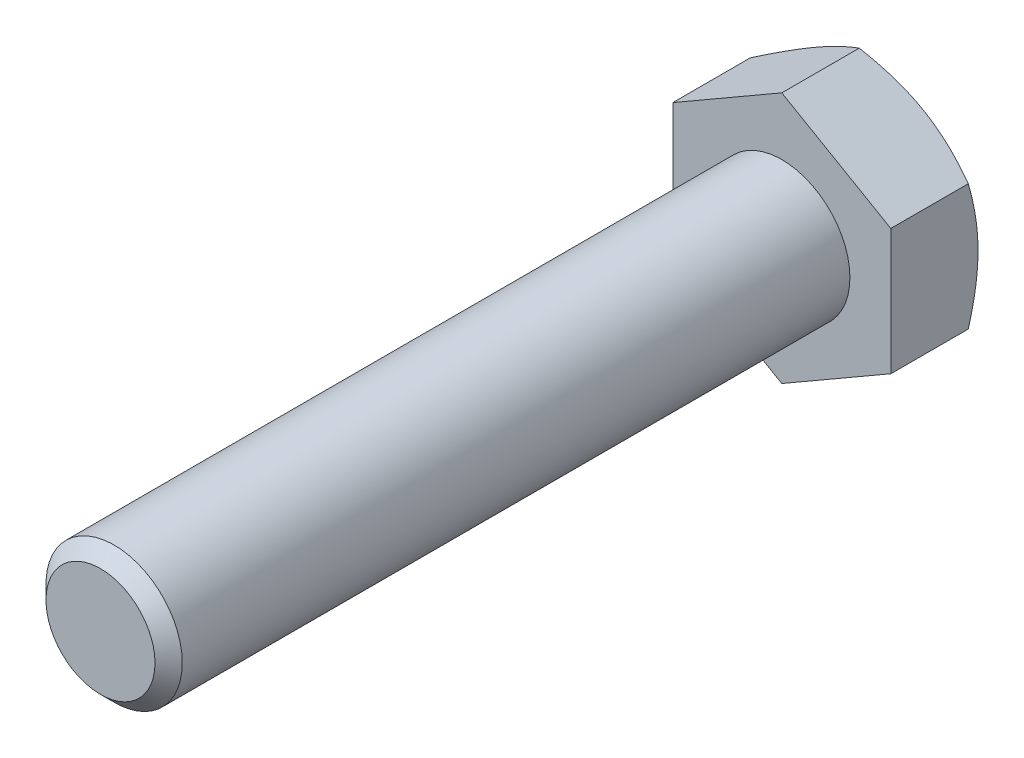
ISO-10303-21;
HEADER;
FILE_DESCRIPTION(('STEP AP214'),'2;1');
FILE_NAME('part.step','',(''),(''),'','','');
FILE_SCHEMA(('AUTOMOTIVE_DESIGN { 1 0 10303 214 1 1 1 1 }'));
ENDSEC;
DATA;
#1=APPLICATION_CONTEXT('core data for automotive mechanical design processes');
#2=APPLICATION_PROTOCOL_DEFINITION('international standard','automotive_design',2000,#1);
#3=PRODUCT_CONTEXT('',#1,'mechanical');
#4=PRODUCT('Part','Part','',(#3));
#5=PRODUCT_RELATED_PRODUCT_CATEGORY('part','',(#4));
#6=PRODUCT_DEFINITION_FORMATION('','',#4);
#7=PRODUCT_DEFINITION_CONTEXT('part definition',#1,'design');
#8=PRODUCT_DEFINITION('design','',#6,#7);
#9=PRODUCT_DEFINITION_SHAPE('','',#8);
#10=(LENGTH_UNIT() NAMED_UNIT(*) SI_UNIT(.MILLI.,.METRE.));
#11=(NAMED_UNIT(*) PLANE_ANGLE_UNIT() SI_UNIT($,.RADIAN.));
#12=(NAMED_UNIT(*) SI_UNIT($,.STERADIAN.) SOLID_ANGLE_UNIT());
#13=UNCERTAINTY_MEASURE_WITH_UNIT(LENGTH_MEASURE(1.E-05),#10,'distance_accuracy_value','');
#14=(GEOMETRIC_REPRESENTATION_CONTEXT(3) GLOBAL_UNCERTAINTY_ASSIGNED_CONTEXT((#13)) GLOBAL_UNIT_ASSIGNED_CONTEXT((#10,
#11,#12)) REPRESENTATION_CONTEXT('',''));
#15=CARTESIAN_POINT('',(0.,0.,0.));
#16=DIRECTION('',(0.,0.,1.));
#17=DIRECTION('',(1.,0.,0.));
#18=AXIS2_PLACEMENT_3D('',#15,#16,#17);
#19=CARTESIAN_POINT('',(1.38777878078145E-13,-3.60822483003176E-13,49.9999999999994));
#20=DIRECTION('',(0.,0.,0.999999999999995));
#21=DIRECTION('',(1.00000000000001,0.,0.));
#22=AXIS2_PLACEMENT_3D('',#19,#20,#21);
#23=PLANE('',#22);
#24=CARTESIAN_POINT('',(1.38777878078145E-13,-3.60822483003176E-13,49.9999999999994));
#25=DIRECTION('',(0.,0.,0.999999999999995));
#26=DIRECTION('',(1.00000000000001,0.,0.));
#27=AXIS2_PLACEMENT_3D('',#24,#25,#26);
#28=CIRCLE('',#27,4.);
#29=CARTESIAN_POINT('',(4.00000000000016,-3.60822483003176E-13,49.9999999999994));
#30=VERTEX_POINT('',#29);
#31=EDGE_CURVE('E265',#30,#30,#28,.T.);
#32=ORIENTED_EDGE('',*,*,#31,.T.);
#33=EDGE_LOOP('',(#32));
#34=FACE_BOUND('',#33,.T.);
#35=ADVANCED_FACE('F34',(#34),#23,.T.);
#36=CARTESIAN_POINT('',(0.,-4.9960036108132E-13,0.));
#37=DIRECTION('',(0.,0.,0.999999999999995));
#38=DIRECTION('',(1.00000000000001,0.,0.));
#39=AXIS2_PLACEMENT_3D('',#36,#37,#38);
#40=CYLINDRICAL_SURFACE('',#39,5.);
#41=CARTESIAN_POINT('',(0.,0.,48.9999999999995));
#42=DIRECTION('',(0.,0.,0.999999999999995));
#43=DIRECTION('',(1.00000000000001,0.,0.));
#44=AXIS2_PLACEMENT_3D('',#41,#42,#43);
#45=CIRCLE('',#44,5.);
#46=CARTESIAN_POINT('',(5.00000000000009,-4.99600361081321E-13,48.9999999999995));
#47=VERTEX_POINT('',#46);
#48=EDGE_CURVE('E236',#47,#47,#45,.F.);
#49=CARTESIAN_POINT('',(0.,-4.9960036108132E-13,0.));
#50=DIRECTION('',(0.,0.,0.999999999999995));
#51=DIRECTION('',(1.00000000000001,0.,0.));
#52=AXIS2_PLACEMENT_3D('',#49,#50,#51);
#53=CIRCLE('',#52,5.);
#54=CARTESIAN_POINT('',(5.00000000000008,-4.9960036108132E-13,0.));
#55=VERTEX_POINT('',#54);
#56=EDGE_CURVE('E262',#55,#55,#53,.F.);
#57=CARTESIAN_POINT('',(5.00000000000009,-4.99600361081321E-13,48.9999999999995));
#58=CARTESIAN_POINT('',(5.00000000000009,-4.99600361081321E-13,48.4895833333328));
#59=CARTESIAN_POINT('',(5.00000000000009,-4.99600361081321E-13,47.9791666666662));
#60=CARTESIAN_POINT('',(5.00000000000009,-4.99600361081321E-13,46.9583333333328));
#61=CARTESIAN_POINT('',(5.00000000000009,-4.99600361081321E-13,46.4479166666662));
#62=CARTESIAN_POINT('',(5.00000000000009,-4.99600361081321E-13,45.4270833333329));
#63=CARTESIAN_POINT('',(5.00000000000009,-4.99600361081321E-13,44.9166666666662));
#64=CARTESIAN_POINT('',(5.00000000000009,-4.99600361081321E-13,43.8958333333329));
#65=CARTESIAN_POINT('',(5.00000000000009,-4.9960036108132E-13,43.3854166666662));
#66=CARTESIAN_POINT('',(5.00000000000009,-4.9960036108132E-13,42.3645833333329));
#67=CARTESIAN_POINT('',(5.00000000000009,-4.9960036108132E-13,41.8541666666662));
#68=CARTESIAN_POINT('',(5.00000000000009,-4.9960036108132E-13,40.8333333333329));
#69=CARTESIAN_POINT('',(5.00000000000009,-4.9960036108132E-13,40.3229166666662));
#70=CARTESIAN_POINT('',(5.00000000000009,-4.9960036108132E-13,39.3020833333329));
#71=CARTESIAN_POINT('',(5.00000000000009,-4.9960036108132E-13,38.7916666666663));
#72=CARTESIAN_POINT('',(5.00000000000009,-4.9960036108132E-13,37.7708333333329));
#73=CARTESIAN_POINT('',(5.00000000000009,-4.9960036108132E-13,37.2604166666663));
#74=CARTESIAN_POINT('',(5.00000000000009,-4.9960036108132E-13,36.239583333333));
#75=CARTESIAN_POINT('',(5.00000000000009,-4.9960036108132E-13,35.7291666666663));
#76=CARTESIAN_POINT('',(5.00000000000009,-4.9960036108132E-13,34.708333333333));
#77=CARTESIAN_POINT('',(5.00000000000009,-4.9960036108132E-13,34.1979166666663));
#78=CARTESIAN_POINT('',(5.00000000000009,-4.9960036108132E-13,33.177083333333));
#79=CARTESIAN_POINT('',(5.00000000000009,-4.9960036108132E-13,32.6666666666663));
#80=CARTESIAN_POINT('',(5.00000000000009,-4.9960036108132E-13,31.645833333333));
#81=CARTESIAN_POINT('',(5.00000000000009,-4.9960036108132E-13,31.1354166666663));
#82=CARTESIAN_POINT('',(5.00000000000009,-4.9960036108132E-13,30.114583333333));
#83=CARTESIAN_POINT('',(5.00000000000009,-4.9960036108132E-13,29.6041666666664));
#84=CARTESIAN_POINT('',(5.00000000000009,-4.9960036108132E-13,28.583333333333));
#85=CARTESIAN_POINT('',(5.00000000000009,-4.9960036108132E-13,28.0729166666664));
#86=CARTESIAN_POINT('',(5.00000000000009,-4.9960036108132E-13,27.0520833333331));
#87=CARTESIAN_POINT('',(5.00000000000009,-4.9960036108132E-13,26.5416666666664));
#88=CARTESIAN_POINT('',(5.00000000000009,-4.9960036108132E-13,25.5208333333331));
#89=CARTESIAN_POINT('',(5.00000000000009,-4.9960036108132E-13,25.0104166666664));
#90=CARTESIAN_POINT('',(5.00000000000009,-4.9960036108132E-13,23.9895833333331));
#91=CARTESIAN_POINT('',(5.00000000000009,-4.9960036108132E-13,23.4791666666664));
#92=CARTESIAN_POINT('',(5.00000000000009,-4.9960036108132E-13,22.4583333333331));
#93=CARTESIAN_POINT('',(5.00000000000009,-4.9960036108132E-13,21.9479166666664));
#94=CARTESIAN_POINT('',(5.00000000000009,-4.9960036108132E-13,20.9270833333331));
#95=CARTESIAN_POINT('',(5.00000000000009,-4.9960036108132E-13,20.4166666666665));
#96=CARTESIAN_POINT('',(5.00000000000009,-4.9960036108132E-13,19.3958333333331));
#97=CARTESIAN_POINT('',(5.00000000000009,-4.9960036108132E-13,18.8854166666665));
#98=CARTESIAN_POINT('',(5.00000000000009,-4.9960036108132E-13,17.8645833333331));
#99=CARTESIAN_POINT('',(5.00000000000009,-4.9960036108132E-13,17.3541666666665));
#100=CARTESIAN_POINT('',(5.00000000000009,-4.9960036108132E-13,16.3333333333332));
#101=CARTESIAN_POINT('',(5.00000000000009,-4.9960036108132E-13,15.8229166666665));
#102=CARTESIAN_POINT('',(5.00000000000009,-4.9960036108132E-13,14.8020833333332));
#103=CARTESIAN_POINT('',(5.00000000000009,-4.9960036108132E-13,14.2916666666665));
#104=CARTESIAN_POINT('',(5.00000000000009,-4.9960036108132E-13,13.2708333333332));
#105=CARTESIAN_POINT('',(5.00000000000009,-4.9960036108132E-13,12.7604166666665));
#106=CARTESIAN_POINT('',(5.00000000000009,-4.9960036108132E-13,11.7395833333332));
#107=CARTESIAN_POINT('',(5.00000000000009,-4.9960036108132E-13,11.2291666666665));
#108=CARTESIAN_POINT('',(5.00000000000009,-4.9960036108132E-13,10.2083333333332));
#109=CARTESIAN_POINT('',(5.00000000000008,-4.9960036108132E-13,9.69791666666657));
#110=CARTESIAN_POINT('',(5.00000000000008,-4.9960036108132E-13,8.67708333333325));
#111=CARTESIAN_POINT('',(5.00000000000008,-4.9960036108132E-13,8.16666666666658));
#112=CARTESIAN_POINT('',(5.00000000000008,-4.9960036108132E-13,7.14583333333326));
#113=CARTESIAN_POINT('',(5.00000000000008,-4.9960036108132E-13,6.6354166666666));
#114=CARTESIAN_POINT('',(5.00000000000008,-4.9960036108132E-13,5.61458333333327));
#115=CARTESIAN_POINT('',(5.00000000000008,-4.9960036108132E-13,5.10416666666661));
#116=CARTESIAN_POINT('',(5.00000000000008,-4.9960036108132E-13,4.08333333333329));
#117=CARTESIAN_POINT('',(5.00000000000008,-4.9960036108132E-13,3.57291666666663));
#118=CARTESIAN_POINT('',(5.00000000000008,-4.9960036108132E-13,2.5520833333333));
#119=CARTESIAN_POINT('',(5.00000000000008,-4.9960036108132E-13,2.04166666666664));
#120=CARTESIAN_POINT('',(5.00000000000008,-4.9960036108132E-13,1.02083333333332));
#121=CARTESIAN_POINT('',(5.00000000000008,-4.9960036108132E-13,0.51041666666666));
#122=CARTESIAN_POINT('',(5.00000000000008,-4.9960036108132E-13,0.));
#123=B_SPLINE_CURVE_WITH_KNOTS('',3,(#57,#58,#59,#60,#61,#62,#63,#64,#65,#66,#67,#68,#69,#70,
#71,#72,#73,#74,#75,#76,#77,#78,#79,#80,#81,#82,#83,#84,#85,#86,#87,#88,#89,#90,#91,#92,#93,#94,
#95,#96,#97,#98,#99,#100,#101,#102,#103,#104,#105,#106,#107,#108,#109,#110,#111,#112,#113,#114,
#115,#116,#117,#118,#119,#120,#121,#122),.UNSPECIFIED.,.F.,.F.,(4,2,2,2,2,2,2,2,2,2,2,2,2,2,2,2,
2,2,2,2,2,2,2,2,2,2,2,2,2,2,2,2,4),(0.,1.53124999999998,3.06249999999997,4.59374999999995,
6.12499999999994,7.65624999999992,9.1874999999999,10.7187499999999,12.2499999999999,
13.7812499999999,15.3124999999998,16.8437499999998,18.3749999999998,19.9062499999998,
21.4374999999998,22.9687499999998,24.4999999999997,26.0312499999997,27.5624999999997,
29.0937499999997,30.6249999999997,32.1562499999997,33.6874999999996,35.2187499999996,
36.7499999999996,38.2812499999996,39.8124999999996,41.3437499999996,42.8749999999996,
44.4062499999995,45.9374999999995,47.4687499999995,48.9999999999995),.UNSPECIFIED.);
#124=EDGE_CURVE('BSEAM200',#47,#55,#123,.T.);
#125=ORIENTED_EDGE('',*,*,#48,.T.);
#126=ORIENTED_EDGE('',*,*,#56,.F.);
#127=ORIENTED_EDGE('',*,*,#124,.T.);
#128=ORIENTED_EDGE('',*,*,#124,.F.);
#129=EDGE_LOOP('',(#125,#127,#126,#128));
#130=FACE_BOUND('',#129,.T.);
#131=ADVANCED_FACE('F200',(#130),#40,.T.);
#132=CARTESIAN_POINT('',(1.38777878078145E-13,-3.60822483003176E-13,49.9999999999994));
#133=DIRECTION('',(0.,0.,-0.999999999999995));
#134=DIRECTION('',(-1.00000000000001,0.,0.));
#135=AXIS2_PLACEMENT_3D('',#132,#133,#134);
#136=CONICAL_SURFACE('',#135,4.,0.785398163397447);
#137=ORIENTED_EDGE('',*,*,#48,.F.);
#138=EDGE_LOOP('',(#137));
#139=FACE_BOUND('',#138,.T.);
#140=ORIENTED_EDGE('',*,*,#31,.F.);
#141=EDGE_LOOP('',(#140));
#142=FACE_BOUND('',#141,.T.);
#143=ADVANCED_FACE('F36',(#139,#142),#136,.T.);
#144=CARTESIAN_POINT('',(0.,9.23760430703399,-6.39999999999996));
#145=DIRECTION('',(0.500000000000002,0.866025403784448,0.));
#146=DIRECTION('',(-0.866025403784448,0.500000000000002,0.));
#147=AXIS2_PLACEMENT_3D('',#144,#145,#146);
#148=PLANE('',#147);
#149=CARTESIAN_POINT('',(-0.000200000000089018,9.23771977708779,-5.68540215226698));
#150=CARTESIAN_POINT('',(0.175648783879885,9.13619343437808,-5.74400928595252));
#151=CARTESIAN_POINT('',(0.352153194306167,9.03428856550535,-5.79995659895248));
#152=CARTESIAN_POINT('',(0.706595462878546,8.82965122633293,-5.90579899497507));
#153=CARTESIAN_POINT('',(0.884533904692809,8.72691841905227,-5.95569146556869));
#154=CARTESIAN_POINT('',(1.4211982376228,8.41707512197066,-6.09530720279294));
#155=CARTESIAN_POINT('',(1.78204258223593,8.20874154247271,-6.17471882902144));
#156=CARTESIAN_POINT('',(2.32203917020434,7.89697436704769,-6.26783835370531));
#157=CARTESIAN_POINT('',(2.4995781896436,7.79447216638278,-6.29436541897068));
#158=CARTESIAN_POINT('',(2.85545911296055,7.58900421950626,-6.33884682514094));
#159=CARTESIAN_POINT('',(3.0338009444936,7.48603851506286,-6.35680192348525));
#160=CARTESIAN_POINT('',(3.39079168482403,7.27992981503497,-6.38368435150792));
#161=CARTESIAN_POINT('',(3.56944001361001,7.17678715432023,-6.39262192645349));
#162=CARTESIAN_POINT('',(3.92690170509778,6.97040655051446,-6.40127769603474));
#163=CARTESIAN_POINT('',(4.10571506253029,6.86716861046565,-6.40099617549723));
#164=CARTESIAN_POINT('',(4.44001336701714,6.6741613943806,-6.39185497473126));
#165=CARTESIAN_POINT('',(4.59552190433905,6.5843784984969,-6.38411039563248));
#166=CARTESIAN_POINT('',(4.90617476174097,6.40502298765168,-6.36179886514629));
#167=CARTESIAN_POINT('',(5.0613190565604,6.31545038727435,-6.34723145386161));
#168=CARTESIAN_POINT('',(5.52615131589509,6.04707935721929,-6.2936393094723));
#169=CARTESIAN_POINT('',(5.83501648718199,5.86875596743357,-6.24473135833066));
#170=CARTESIAN_POINT('',(6.45602322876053,5.5102175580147,-6.12246059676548));
#171=CARTESIAN_POINT('',(6.76808554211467,5.33004829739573,-6.04857947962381));
#172=CARTESIAN_POINT('',(7.38755648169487,4.97239658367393,-5.88089985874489));
#173=CARTESIAN_POINT('',(7.69497304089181,4.7949095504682,-5.78714073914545));
#174=CARTESIAN_POINT('',(8.00020000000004,4.61868668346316,-5.68540215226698));
#175=B_SPLINE_CURVE_WITH_KNOTS('',3,(#149,#150,#151,#152,#153,#154,#155,#156,#157,#158,#159,
#160,#161,#162,#163,#164,#165,#166,#167,#168,#169,#170,#171,#172,#173,#174),.UNSPECIFIED.,.F.,
.F.,(4,2,2,2,2,2,2,2,2,2,2,2,4),(0.,0.633973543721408,1.26821965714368,2.53934712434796,
3.15934343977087,3.77928496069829,4.39852133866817,5.01773858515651,5.55680239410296,
6.09590254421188,7.17487077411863,8.27776850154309,9.37850115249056),.UNSPECIFIED.);
#176=CARTESIAN_POINT('',(0.,9.23760430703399,-5.68546882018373));
#177=VERTEX_POINT('',#176);
#178=CARTESIAN_POINT('',(3.99999999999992,6.92820323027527,-6.39999999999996));
#179=VERTEX_POINT('',#178);
#180=EDGE_CURVE('E224',#177,#179,#175,.T.);
#181=ORIENTED_EDGE('',*,*,#180,.F.);
#182=DIRECTION('',(0.,0.,0.999999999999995));
#183=VECTOR('',#182,1.);
#184=CARTESIAN_POINT('',(0.,9.23760430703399,-6.39999999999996));
#185=LINE('',#184,#183);
#186=CARTESIAN_POINT('',(0.,9.23760430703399,0.));
#187=VERTEX_POINT('',#186);
#188=EDGE_CURVE('E221',#177,#187,#185,.T.);
#189=ORIENTED_EDGE('',*,*,#188,.T.);
#190=DIRECTION('',(-0.866025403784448,0.500000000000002,0.));
#191=VECTOR('',#190,1.);
#192=CARTESIAN_POINT('',(0.,9.23760430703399,0.));
#193=LINE('',#192,#191);
#194=CARTESIAN_POINT('',(8.00000000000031,4.61880215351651,0.));
#195=VERTEX_POINT('',#194);
#196=EDGE_CURVE('E229',#195,#187,#193,.T.);
#197=ORIENTED_EDGE('',*,*,#196,.F.);
#198=DIRECTION('',(0.,0.,0.999999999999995));
#199=VECTOR('',#198,1.);
#200=CARTESIAN_POINT('',(8.00000000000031,4.61880215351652,-6.39999999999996));
#201=LINE('',#200,#199);
#202=CARTESIAN_POINT('',(8.00000000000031,4.61880215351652,-5.68546882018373));
#203=VERTEX_POINT('',#202);
#204=EDGE_CURVE('E254',#203,#195,#201,.T.);
#205=ORIENTED_EDGE('',*,*,#204,.F.);
#206=EDGE_CURVE('E174',#179,#203,#175,.T.);
#207=ORIENTED_EDGE('',*,*,#206,.F.);
#208=EDGE_LOOP('',(#181,#189,#197,#205,#207));
#209=FACE_BOUND('',#208,.T.);
#210=ADVANCED_FACE('F184',(#209),#148,.T.);
#211=CARTESIAN_POINT('',(8.00000000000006,-4.61880215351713,-6.39999999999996));
#212=DIRECTION('',(1.00000000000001,0.,0.));
#213=DIRECTION('',(0.,1.00000000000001,0.));
#214=AXIS2_PLACEMENT_3D('',#211,#212,#213);
#215=PLANE('',#214);
#216=CARTESIAN_POINT('',(8.00000000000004,-12.5978512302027,-2.4028120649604));
#217=CARTESIAN_POINT('',(8.00000000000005,-12.246746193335,-2.57388946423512));
#218=CARTESIAN_POINT('',(8.00000000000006,-11.8948553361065,-2.74338074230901));
#219=CARTESIAN_POINT('',(8.00000000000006,-11.1890846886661,-3.07830251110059));
#220=CARTESIAN_POINT('',(8.00000000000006,-10.835204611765,-3.24373239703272));
#221=CARTESIAN_POINT('',(8.00000000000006,-10.123305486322,-3.57043443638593));
#222=CARTESIAN_POINT('',(8.00000000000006,-9.76527449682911,-3.73168065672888));
#223=CARTESIAN_POINT('',(8.00000000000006,-9.04643054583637,-4.04782365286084));
#224=CARTESIAN_POINT('',(8.00000000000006,-8.68561771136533,-4.20272071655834));
#225=CARTESIAN_POINT('',(8.00000000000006,-7.9483682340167,-4.50960168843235));
#226=CARTESIAN_POINT('',(8.00000000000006,-7.57181608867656,-4.66130959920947));
#227=CARTESIAN_POINT('',(8.00000000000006,-6.81437869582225,-4.95369969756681));
#228=CARTESIAN_POINT('',(8.00000000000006,-6.43349297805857,-5.09438067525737));
#229=CARTESIAN_POINT('',(8.00000000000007,-5.66743059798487,-5.36116349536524));
#230=CARTESIAN_POINT('',(8.00000000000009,-5.28226375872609,-5.48729325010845));
#231=CARTESIAN_POINT('',(8.00000000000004,-4.50642197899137,-5.72105487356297));
#232=CARTESIAN_POINT('',(7.99999999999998,-4.11574875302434,-5.82869236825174));
#233=CARTESIAN_POINT('',(7.99999999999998,-3.33076858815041,-6.01985550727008));
#234=CARTESIAN_POINT('',(8.00000000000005,-2.93649538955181,-6.10351603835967));
#235=CARTESIAN_POINT('',(8.00000000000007,-2.34134760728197,-6.20749259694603));
#236=CARTESIAN_POINT('',(8.00000000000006,-2.14232908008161,-6.23856705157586));
#237=CARTESIAN_POINT('',(8.00000000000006,-1.7432391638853,-6.29294025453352));
#238=CARTESIAN_POINT('',(8.00000000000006,-1.54316787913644,-6.31623975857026));
#239=CARTESIAN_POINT('',(8.00000000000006,-1.14493807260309,-6.35429623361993));
#240=CARTESIAN_POINT('',(8.00000000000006,-0.946790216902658,-6.36916434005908));
#241=CARTESIAN_POINT('',(8.00000000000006,-0.550042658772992,-6.39050002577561));
#242=CARTESIAN_POINT('',(8.00000000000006,-0.351442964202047,-6.39696775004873));
#243=CARTESIAN_POINT('',(8.00000000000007,0.0458536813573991,-6.40134753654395));
#244=CARTESIAN_POINT('',(8.00000000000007,0.244550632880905,-6.39925955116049));
#245=CARTESIAN_POINT('',(8.00000000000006,0.641675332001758,-6.38658102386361));
#246=CARTESIAN_POINT('',(8.00000000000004,0.840103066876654,-6.37599009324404));
#247=CARTESIAN_POINT('',(8.00000000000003,1.31123186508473,-6.34097810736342));
#248=CARTESIAN_POINT('',(8.00000000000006,1.58366327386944,-6.31284309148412));
#249=CARTESIAN_POINT('',(8.00000000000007,2.12661564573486,-6.24203710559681));
#250=CARTESIAN_POINT('',(8.00000000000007,2.39713636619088,-6.19936432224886));
#251=CARTESIAN_POINT('',(8.00000000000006,3.20545284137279,-6.0517930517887));
#252=CARTESIAN_POINT('',(8.00000000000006,3.73973646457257,-5.92736416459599));
#253=CARTESIAN_POINT('',(8.00000000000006,4.53906436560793,-5.71012995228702));
#254=CARTESIAN_POINT('',(8.00000000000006,4.8082118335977,-5.63154182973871));
#255=CARTESIAN_POINT('',(8.00000000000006,5.34389592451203,-5.46584170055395));
#256=CARTESIAN_POINT('',(8.00000000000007,5.61043252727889,-5.37872962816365));
#257=CARTESIAN_POINT('',(8.00000000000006,6.14097486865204,-5.19740915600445));
#258=CARTESIAN_POINT('',(8.00000000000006,6.40498129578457,-5.10320275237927));
#259=CARTESIAN_POINT('',(8.00000000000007,6.93077992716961,-4.90883812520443));
#260=CARTESIAN_POINT('',(8.00000000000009,7.19257218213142,-4.80868003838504));
#261=CARTESIAN_POINT('',(8.0000000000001,7.89757234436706,-4.53123135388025));
#262=CARTESIAN_POINT('',(8.00000000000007,8.33892089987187,-4.34922056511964));
#263=CARTESIAN_POINT('',(8.00000000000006,9.21706508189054,-3.97449001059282));
#264=CARTESIAN_POINT('',(8.00000000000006,9.65386019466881,-3.78176905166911));
#265=CARTESIAN_POINT('',(8.00000000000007,10.5239434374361,-3.3881548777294));
#266=CARTESIAN_POINT('',(8.00000000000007,10.9572301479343,-3.18725853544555));
#267=CARTESIAN_POINT('',(8.00000000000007,11.8208356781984,-2.77925077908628));
#268=CARTESIAN_POINT('',(8.00000000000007,12.2511546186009,-2.5721396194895));
#269=CARTESIAN_POINT('',(8.00000000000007,13.110106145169,-2.15271844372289));
#270=CARTESIAN_POINT('',(8.00000000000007,13.5387348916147,-1.94040058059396));
#271=CARTESIAN_POINT('',(8.00000000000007,14.3940561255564,-1.51189757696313));
#272=CARTESIAN_POINT('',(8.00000000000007,14.820748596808,-1.29571240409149));
#273=CARTESIAN_POINT('',(8.00000000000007,15.6724483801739,-0.860283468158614));
#274=CARTESIAN_POINT('',(8.00000000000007,16.0974560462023,-0.641040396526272));
#275=CARTESIAN_POINT('',(8.00000000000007,16.9461557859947,-0.200021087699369));
#276=CARTESIAN_POINT('',(8.00000000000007,17.3698478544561,0.0217551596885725));
#277=CARTESIAN_POINT('',(8.00000000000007,18.5495919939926,0.642968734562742));
#278=CARTESIAN_POINT('',(8.00000000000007,19.3044430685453,1.04468640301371));
#279=CARTESIAN_POINT('',(8.00000000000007,20.811612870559,1.85294502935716));
#280=CARTESIAN_POINT('',(8.00000000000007,21.5639314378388,2.25948628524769));
#281=CARTESIAN_POINT('',(8.00000000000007,23.0640825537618,3.07479055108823));
#282=CARTESIAN_POINT('',(8.00000000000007,23.8119216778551,3.48354147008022));
#283=CARTESIAN_POINT('',(8.00000000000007,24.9325210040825,4.09870759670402));
#284=CARTESIAN_POINT('',(8.00000000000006,25.3058462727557,4.30409483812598));
#285=CARTESIAN_POINT('',(8.00000000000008,26.0521604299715,4.71547851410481));
#286=CARTESIAN_POINT('',(8.0000000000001,26.4251493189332,4.92147494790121));
#287=CARTESIAN_POINT('',(8.00000000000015,26.7979906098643,5.12773824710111));
#288=B_SPLINE_CURVE_WITH_KNOTS('',3,(#216,#217,#218,#219,#220,#221,#222,#223,#224,#225,#226,
#227,#228,#229,#230,#231,#232,#233,#234,#235,#236,#237,#238,#239,#240,#241,#242,#243,#244,#245,
#246,#247,#248,#249,#250,#251,#252,#253,#254,#255,#256,#257,#258,#259,#260,#261,#262,#263,#264,
#265,#266,#267,#268,#269,#270,#271,#272,#273,#274,#275,#276,#277,#278,#279,#280,#281,#282,#283,
#284,#285,#286,#287),.UNSPECIFIED.,.F.,.F.,(4,2,2,2,2,2,2,2,2,2,2,2,2,2,2,2,2,2,2,2,2,2,2,2,2,2,
2,2,2,2,2,2,2,2,2,4),(0.,1.17171303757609,2.34359951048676,3.52154779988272,4.69944261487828,
5.9172006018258,7.13509201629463,8.35060698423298,9.56575149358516,10.7739194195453,
11.3780811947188,11.982184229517,12.5781274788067,13.1740604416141,13.7699967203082,
14.3659602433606,15.1871414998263,16.0084252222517,17.651791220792,18.4928743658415,
19.3339639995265,20.1748178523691,21.0156523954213,22.4476587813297,23.8798250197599,
25.3125443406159,26.7452050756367,28.1801767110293,29.6151603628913,31.049824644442,
32.4844947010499,35.0497345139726,37.6151336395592,40.1718943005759,41.4501744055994,
42.7284529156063),.UNSPECIFIED.);
#289=CARTESIAN_POINT('',(8.00000000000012,0.,-6.39999999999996));
#290=VERTEX_POINT('',#289);
#291=EDGE_CURVE('E172',#203,#290,#288,.F.);
#292=ORIENTED_EDGE('',*,*,#291,.F.);
#293=ORIENTED_EDGE('',*,*,#204,.T.);
#294=DIRECTION('',(0.,1.00000000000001,0.));
#295=VECTOR('',#294,1.);
#296=CARTESIAN_POINT('',(8.00000000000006,-4.61880215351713,0.));
#297=LINE('',#296,#295);
#298=CARTESIAN_POINT('',(8.00000000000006,-4.61880215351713,0.));
#299=VERTEX_POINT('',#298);
#300=EDGE_CURVE('E261',#299,#195,#297,.T.);
#301=ORIENTED_EDGE('',*,*,#300,.F.);
#302=DIRECTION('',(0.,0.,0.999999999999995));
#303=VECTOR('',#302,1.);
#304=CARTESIAN_POINT('',(8.00000000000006,-4.61880215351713,-6.39999999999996));
#305=LINE('',#304,#303);
#306=CARTESIAN_POINT('',(8.00000000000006,-4.61880215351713,-5.68546882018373));
#307=VERTEX_POINT('',#306);
#308=EDGE_CURVE('E239',#307,#299,#305,.T.);
#309=ORIENTED_EDGE('',*,*,#308,.F.);
#310=EDGE_CURVE('E167',#290,#307,#288,.F.);
#311=ORIENTED_EDGE('',*,*,#310,.F.);
#312=EDGE_LOOP('',(#292,#293,#301,#309,#311));
#313=FACE_BOUND('',#312,.T.);
#314=ADVANCED_FACE('F180',(#313),#215,.T.);
#315=CARTESIAN_POINT('',(0.,-9.23760430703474,-6.39999999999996));
#316=DIRECTION('',(0.500000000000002,-0.866025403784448,0.));
#317=DIRECTION('',(0.866025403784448,0.500000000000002,0.));
#318=AXIS2_PLACEMENT_3D('',#315,#316,#317);
#319=PLANE('',#318);
#320=CARTESIAN_POINT('',(8.00020000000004,-4.61868668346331,-5.68540215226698));
#321=CARTESIAN_POINT('',(7.82435121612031,-4.72021302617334,-5.7440092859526));
#322=CARTESIAN_POINT('',(7.64784680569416,-4.82211789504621,-5.79995659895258));
#323=CARTESIAN_POINT('',(7.2934045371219,-5.02675523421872,-5.90579899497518));
#324=CARTESIAN_POINT('',(7.11546609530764,-5.12948804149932,-5.95569146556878));
#325=CARTESIAN_POINT('',(6.5788017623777,-5.43933133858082,-6.095307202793));
#326=CARTESIAN_POINT('',(6.21795741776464,-5.64766491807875,-6.17471882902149));
#327=CARTESIAN_POINT('',(5.67796082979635,-5.95943209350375,-6.26783835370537));
#328=CARTESIAN_POINT('',(5.50042181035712,-6.06193429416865,-6.29436541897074));
#329=CARTESIAN_POINT('',(5.14454088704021,-6.2674022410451,-6.338846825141));
#330=CARTESIAN_POINT('',(4.96619905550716,-6.37036794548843,-6.35680192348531));
#331=CARTESIAN_POINT('',(4.60920831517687,-6.57647664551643,-6.38368435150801));
#332=CARTESIAN_POINT('',(4.43055998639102,-6.67961930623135,-6.39262192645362));
#333=CARTESIAN_POINT('',(4.073098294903,-6.88599991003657,-6.40127769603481));
#334=CARTESIAN_POINT('',(3.89428493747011,-6.98923785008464,-6.40099617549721));
#335=CARTESIAN_POINT('',(3.5599866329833,-7.18224506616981,-6.39185497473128));
#336=CARTESIAN_POINT('',(3.40447809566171,-7.27202796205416,-6.38411039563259));
#337=CARTESIAN_POINT('',(3.09382523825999,-7.45138347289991,-6.36179886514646));
#338=CARTESIAN_POINT('',(2.93868094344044,-7.5409560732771,-6.34723145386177));
#339=CARTESIAN_POINT('',(2.47384868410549,-7.80932710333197,-6.29363930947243));
#340=CARTESIAN_POINT('',(2.16498351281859,-7.98765049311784,-6.2447313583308));
#341=CARTESIAN_POINT('',(1.54397677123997,-8.34618890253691,-6.12246059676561));
#342=CARTESIAN_POINT('',(1.23191445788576,-8.52635816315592,-6.04857947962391));
#343=CARTESIAN_POINT('',(0.612443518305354,-8.8840098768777,-5.88089985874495));
#344=CARTESIAN_POINT('',(0.305026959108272,-9.06149691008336,-5.78714073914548));
#345=CARTESIAN_POINT('',(-0.000200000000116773,-9.23771977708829,-5.68540215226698));
#346=B_SPLINE_CURVE_WITH_KNOTS('',3,(#320,#321,#322,#323,#324,#325,#326,#327,#328,#329,#330,
#331,#332,#333,#334,#335,#336,#337,#338,#339,#340,#341,#342,#343,#344,#345),.UNSPECIFIED.,.F.,
.F.,(4,2,2,2,2,2,2,2,2,2,2,2,4),(0.,0.633973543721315,1.26821965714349,2.53934712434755,
3.15934343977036,3.77928496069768,4.39852133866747,5.01773858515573,5.55680239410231,
6.09590254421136,7.17487077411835,8.27776850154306,9.3785011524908),.UNSPECIFIED.);
#347=CARTESIAN_POINT('',(3.99999999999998,-6.92820323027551,-6.39999999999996));
#348=VERTEX_POINT('',#347);
#349=EDGE_CURVE('E173',#307,#348,#346,.T.);
#350=ORIENTED_EDGE('',*,*,#349,.F.);
#351=ORIENTED_EDGE('',*,*,#308,.T.);
#352=DIRECTION('',(0.866025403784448,0.500000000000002,0.));
#353=VECTOR('',#352,1.);
#354=CARTESIAN_POINT('',(1.94289029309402E-13,-9.23760430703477,0.));
#355=LINE('',#354,#353);
#356=CARTESIAN_POINT('',(1.94289029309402E-13,-9.23760430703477,0.));
#357=VERTEX_POINT('',#356);
#358=EDGE_CURVE('E250',#357,#299,#355,.T.);
#359=ORIENTED_EDGE('',*,*,#358,.F.);
#360=DIRECTION('',(0.,0.,0.999999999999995));
#361=VECTOR('',#360,1.);
#362=CARTESIAN_POINT('',(0.,-9.23760430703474,-6.39999999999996));
#363=LINE('',#362,#361);
#364=CARTESIAN_POINT('',(1.94289029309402E-13,-9.23760430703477,-5.68546882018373));
#365=VERTEX_POINT('',#364);
#366=EDGE_CURVE('E249',#365,#357,#363,.T.);
#367=ORIENTED_EDGE('',*,*,#366,.F.);
#368=EDGE_CURVE('E161',#348,#365,#346,.T.);
#369=ORIENTED_EDGE('',*,*,#368,.F.);
#370=EDGE_LOOP('',(#350,#351,#359,#367,#369));
#371=FACE_BOUND('',#370,.T.);
#372=ADVANCED_FACE('F183',(#371),#319,.T.);
#373=CARTESIAN_POINT('',(0.,-9.23760430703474,-6.39999999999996));
#374=DIRECTION('',(-0.500000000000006,-0.866025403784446,0.));
#375=DIRECTION('',(0.866025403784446,-0.500000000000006,0.));
#376=AXIS2_PLACEMENT_3D('',#373,#374,#375);
#377=PLANE('',#376);
#378=CARTESIAN_POINT('',(0.000200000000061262,-9.23771977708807,-5.68540215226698));
#379=CARTESIAN_POINT('',(-0.175648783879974,-9.13619343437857,-5.74400928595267));
#380=CARTESIAN_POINT('',(-0.352153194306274,-9.03428856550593,-5.79995659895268));
#381=CARTESIAN_POINT('',(-0.706595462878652,-8.82965122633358,-5.9057989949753));
#382=CARTESIAN_POINT('',(-0.884533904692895,-8.72691841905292,-5.9556914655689));
#383=CARTESIAN_POINT('',(-1.42119823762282,-8.41707512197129,-6.0953072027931));
#384=CARTESIAN_POINT('',(-1.78204258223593,-8.20874154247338,-6.1747188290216));
#385=CARTESIAN_POINT('',(-2.32203917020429,-7.89697436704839,-6.26783835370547));
#386=CARTESIAN_POINT('',(-2.49957818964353,-7.79447216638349,-6.29436541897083));
#387=CARTESIAN_POINT('',(-2.85545911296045,-7.58900421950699,-6.33884682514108));
#388=CARTESIAN_POINT('',(-3.03380094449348,-7.48603851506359,-6.35680192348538));
#389=CARTESIAN_POINT('',(-3.39079168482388,-7.27992981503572,-6.38368435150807));
#390=CARTESIAN_POINT('',(-3.56944001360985,-7.176787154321,-6.39262192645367));
#391=CARTESIAN_POINT('',(-3.92690170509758,-6.97040655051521,-6.40127769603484));
#392=CARTESIAN_POINT('',(-4.10571506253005,-6.86716861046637,-6.40099617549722));
#393=CARTESIAN_POINT('',(-4.44001336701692,-6.67416139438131,-6.39185497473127));
#394=CARTESIAN_POINT('',(-4.59552190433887,-6.58437849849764,-6.38411039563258));
#395=CARTESIAN_POINT('',(-4.90617476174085,-6.40502298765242,-6.36179886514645));
#396=CARTESIAN_POINT('',(-5.06131905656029,-6.31545038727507,-6.34723145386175));
#397=CARTESIAN_POINT('',(-5.52615131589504,-6.04707935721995,-6.29363930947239));
#398=CARTESIAN_POINT('',(-5.83501648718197,-5.86875596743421,-6.24473135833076));
#399=CARTESIAN_POINT('',(-6.45602322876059,-5.51021755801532,-6.12246059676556));
#400=CARTESIAN_POINT('',(-6.76808554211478,-5.33004829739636,-6.04857947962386));
#401=CARTESIAN_POINT('',(-7.38755648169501,-4.97239658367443,-5.88089985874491));
#402=CARTESIAN_POINT('',(-7.69497304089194,-4.79490955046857,-5.78714073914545));
#403=CARTESIAN_POINT('',(-8.00020000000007,-4.61868668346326,-5.68540215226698));
#404=B_SPLINE_CURVE_WITH_KNOTS('',3,(#378,#379,#380,#381,#382,#383,#384,#385,#386,#387,#388,
#389,#390,#391,#392,#393,#394,#395,#396,#397,#398,#399,#400,#401,#402,#403),.UNSPECIFIED.,.F.,
.F.,(4,2,2,2,2,2,2,2,2,2,2,2,4),(0.,0.633973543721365,1.26821965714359,2.53934712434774,
3.1593434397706,3.77928496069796,4.3985213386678,5.0177385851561,5.55680239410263,
6.09590254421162,7.17487077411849,8.27776850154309,9.37850115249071),.UNSPECIFIED.);
#405=CARTESIAN_POINT('',(-3.99999999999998,-6.92820323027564,-6.39999999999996));
#406=VERTEX_POINT('',#405);
#407=EDGE_CURVE('E245',#365,#406,#404,.T.);
#408=ORIENTED_EDGE('',*,*,#407,.F.);
#409=ORIENTED_EDGE('',*,*,#366,.T.);
#410=DIRECTION('',(0.866025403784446,-0.500000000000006,0.));
#411=VECTOR('',#410,1.);
#412=CARTESIAN_POINT('',(1.94289029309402E-13,-9.23760430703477,0.));
#413=LINE('',#412,#411);
#414=CARTESIAN_POINT('',(-7.99999999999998,-4.61880215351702,0.));
#415=VERTEX_POINT('',#414);
#416=EDGE_CURVE('E351',#415,#357,#413,.T.);
#417=ORIENTED_EDGE('',*,*,#416,.F.);
#418=DIRECTION('',(0.,0.,0.999999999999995));
#419=VECTOR('',#418,1.);
#420=CARTESIAN_POINT('',(-7.99999999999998,-4.61880215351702,-6.39999999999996));
#421=LINE('',#420,#419);
#422=CARTESIAN_POINT('',(-7.99999999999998,-4.61880215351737,-5.68546882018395));
#423=VERTEX_POINT('',#422);
#424=EDGE_CURVE('E252',#423,#415,#421,.T.);
#425=ORIENTED_EDGE('',*,*,#424,.F.);
#426=EDGE_CURVE('E111',#406,#423,#404,.T.);
#427=ORIENTED_EDGE('',*,*,#426,.F.);
#428=EDGE_LOOP('',(#408,#409,#417,#425,#427));
#429=FACE_BOUND('',#428,.T.);
#430=ADVANCED_FACE('F189',(#429),#377,.T.);
#431=CARTESIAN_POINT('',(-7.99999999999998,-4.61880215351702,-6.39999999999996));
#432=DIRECTION('',(-1.00000000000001,0.,0.));
#433=DIRECTION('',(0.,0.,0.999999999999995));
#434=AXIS2_PLACEMENT_3D('',#431,#432,#433);
#435=PLANE('',#434);
#436=CARTESIAN_POINT('',(-8.00000000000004,-12.5978512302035,-2.4028120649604));
#437=CARTESIAN_POINT('',(-8.,-12.2467461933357,-2.57388946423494));
#438=CARTESIAN_POINT('',(-7.99999999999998,-11.8948553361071,-2.74338074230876));
#439=CARTESIAN_POINT('',(-7.99999999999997,-11.1890846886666,-3.07830251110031));
#440=CARTESIAN_POINT('',(-7.99999999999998,-10.8352046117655,-3.24373239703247));
#441=CARTESIAN_POINT('',(-7.99999999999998,-10.1233054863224,-3.57043443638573));
#442=CARTESIAN_POINT('',(-7.99999999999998,-9.76527449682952,-3.73168065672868));
#443=CARTESIAN_POINT('',(-7.99999999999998,-9.04643054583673,-4.04782365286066));
#444=CARTESIAN_POINT('',(-7.99999999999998,-8.68561771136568,-4.20272071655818));
#445=CARTESIAN_POINT('',(-7.99999999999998,-7.948368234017,-4.50960168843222));
#446=CARTESIAN_POINT('',(-7.99999999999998,-7.57181608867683,-4.66130959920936));
#447=CARTESIAN_POINT('',(-7.99999999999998,-6.81437869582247,-4.95369969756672));
#448=CARTESIAN_POINT('',(-7.99999999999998,-6.43349297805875,-5.09438067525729));
#449=CARTESIAN_POINT('',(-7.99999999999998,-5.66743059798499,-5.36116349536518));
#450=CARTESIAN_POINT('',(-7.99999999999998,-5.28226375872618,-5.4872932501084));
#451=CARTESIAN_POINT('',(-7.99999999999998,-4.50642197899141,-5.72105487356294));
#452=CARTESIAN_POINT('',(-7.99999999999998,-4.11574875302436,-5.82869236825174));
#453=CARTESIAN_POINT('',(-7.99999999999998,-3.33076858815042,-6.01985550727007));
#454=CARTESIAN_POINT('',(-7.99999999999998,-2.93649538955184,-6.10351603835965));
#455=CARTESIAN_POINT('',(-7.99999999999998,-2.34134760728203,-6.207492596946));
#456=CARTESIAN_POINT('',(-7.99999999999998,-2.14232908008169,-6.23856705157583));
#457=CARTESIAN_POINT('',(-7.99999999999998,-1.7432391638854,-6.29294025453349));
#458=CARTESIAN_POINT('',(-7.99999999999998,-1.54316787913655,-6.31623975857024));
#459=CARTESIAN_POINT('',(-7.99999999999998,-1.14493807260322,-6.3542962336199));
#460=CARTESIAN_POINT('',(-7.99999999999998,-0.946790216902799,-6.36916434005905));
#461=CARTESIAN_POINT('',(-7.99999999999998,-0.550042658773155,-6.39050002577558));
#462=CARTESIAN_POINT('',(-7.99999999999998,-0.35144296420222,-6.3969677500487));
#463=CARTESIAN_POINT('',(-7.99999999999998,0.0458536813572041,-6.40134753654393));
#464=CARTESIAN_POINT('',(-7.99999999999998,0.244550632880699,-6.39925955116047));
#465=CARTESIAN_POINT('',(-7.99999999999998,0.64167533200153,-6.3865810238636));
#466=CARTESIAN_POINT('',(-7.99999999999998,0.840103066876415,-6.37599009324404));
#467=CARTESIAN_POINT('',(-7.99999999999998,1.3112318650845,-6.34097810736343));
#468=CARTESIAN_POINT('',(-7.99999999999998,1.58366327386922,-6.31284309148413));
#469=CARTESIAN_POINT('',(-7.99999999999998,2.12661564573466,-6.24203710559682));
#470=CARTESIAN_POINT('',(-7.99999999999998,2.39713636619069,-6.19936432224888));
#471=CARTESIAN_POINT('',(-7.99999999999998,3.20545284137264,-6.05179305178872));
#472=CARTESIAN_POINT('',(-7.99999999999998,3.73973646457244,-5.92736416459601));
#473=CARTESIAN_POINT('',(-7.99999999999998,4.53906436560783,-5.71012995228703));
#474=CARTESIAN_POINT('',(-7.99999999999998,4.80821183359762,-5.63154182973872));
#475=CARTESIAN_POINT('',(-7.99999999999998,5.34389592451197,-5.46584170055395));
#476=CARTESIAN_POINT('',(-7.99999999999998,5.61043252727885,-5.37872962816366));
#477=CARTESIAN_POINT('',(-7.99999999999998,6.14097486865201,-5.19740915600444));
#478=CARTESIAN_POINT('',(-7.99999999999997,6.40498129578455,-5.10320275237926));
#479=CARTESIAN_POINT('',(-7.99999999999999,6.93077992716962,-4.90883812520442));
#480=CARTESIAN_POINT('',(-8.,7.19257218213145,-4.80868003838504));
#481=CARTESIAN_POINT('',(-8.00000000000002,7.8975723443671,-4.53123135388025));
#482=CARTESIAN_POINT('',(-7.99999999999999,8.33892089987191,-4.34922056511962));
#483=CARTESIAN_POINT('',(-7.99999999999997,9.21706508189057,-3.97449001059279));
#484=CARTESIAN_POINT('',(-7.99999999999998,9.65386019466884,-3.78176905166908));
#485=CARTESIAN_POINT('',(-7.99999999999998,10.5239434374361,-3.38815487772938));
#486=CARTESIAN_POINT('',(-7.99999999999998,10.9572301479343,-3.18725853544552));
#487=CARTESIAN_POINT('',(-7.99999999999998,11.8208356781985,-2.77925077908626));
#488=CARTESIAN_POINT('',(-7.99999999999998,12.251154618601,-2.57213961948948));
#489=CARTESIAN_POINT('',(-7.99999999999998,13.110106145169,-2.15271844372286));
#490=CARTESIAN_POINT('',(-7.99999999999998,13.5387348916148,-1.94040058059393));
#491=CARTESIAN_POINT('',(-7.99999999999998,14.3940561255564,-1.5118975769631));
#492=CARTESIAN_POINT('',(-7.99999999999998,14.820748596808,-1.29571240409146));
#493=CARTESIAN_POINT('',(-7.99999999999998,15.6724483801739,-0.860283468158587));
#494=CARTESIAN_POINT('',(-7.99999999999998,16.0974560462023,-0.641040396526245));
#495=CARTESIAN_POINT('',(-7.99999999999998,16.9461557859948,-0.200021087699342));
#496=CARTESIAN_POINT('',(-7.99999999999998,17.3698478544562,0.0217551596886));
#497=CARTESIAN_POINT('',(-7.99999999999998,18.5495919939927,0.64296873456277));
#498=CARTESIAN_POINT('',(-7.99999999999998,19.3044430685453,1.04468640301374));
#499=CARTESIAN_POINT('',(-7.99999999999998,20.8116128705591,1.85294502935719));
#500=CARTESIAN_POINT('',(-7.99999999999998,21.5639314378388,2.25948628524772));
#501=CARTESIAN_POINT('',(-7.99999999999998,23.0640825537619,3.07479055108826));
#502=CARTESIAN_POINT('',(-7.99999999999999,23.8119216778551,3.48354147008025));
#503=CARTESIAN_POINT('',(-7.99999999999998,24.9325210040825,4.09870759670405));
#504=CARTESIAN_POINT('',(-7.99999999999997,25.3058462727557,4.30409483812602));
#505=CARTESIAN_POINT('',(-7.99999999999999,26.0521604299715,4.71547851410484));
#506=CARTESIAN_POINT('',(-8.00000000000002,26.4251493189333,4.92147494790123));
#507=CARTESIAN_POINT('',(-8.00000000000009,26.7979906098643,5.12773824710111));
#508=B_SPLINE_CURVE_WITH_KNOTS('',3,(#436,#437,#438,#439,#440,#441,#442,#443,#444,#445,#446,
#447,#448,#449,#450,#451,#452,#453,#454,#455,#456,#457,#458,#459,#460,#461,#462,#463,#464,#465,
#466,#467,#468,#469,#470,#471,#472,#473,#474,#475,#476,#477,#478,#479,#480,#481,#482,#483,#484,
#485,#486,#487,#488,#489,#490,#491,#492,#493,#494,#495,#496,#497,#498,#499,#500,#501,#502,#503,
#504,#505,#506,#507),.UNSPECIFIED.,.F.,.F.,(4,2,2,2,2,2,2,2,2,2,2,2,2,2,2,2,2,2,2,2,2,2,2,2,2,2,
2,2,2,2,2,2,2,2,2,4),(0.,1.17171303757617,2.34359951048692,3.52154779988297,4.6994426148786,
5.91720060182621,7.13509201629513,8.35060698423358,9.56575149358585,10.7739194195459,
11.3780811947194,11.9821842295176,12.5781274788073,13.1740604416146,13.7699967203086,
14.365960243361,15.1871414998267,16.0084252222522,17.6517912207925,18.4928743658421,
19.3339639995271,20.1748178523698,21.015652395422,22.4476587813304,23.8798250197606,
25.3125443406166,26.7452050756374,28.18017671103,29.615160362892,31.0498246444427,
32.4844947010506,35.0497345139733,37.6151336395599,40.1718943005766,41.4501744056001,
42.728452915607),.UNSPECIFIED.);
#509=CARTESIAN_POINT('',(-7.99999999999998,0.,-6.39999999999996));
#510=VERTEX_POINT('',#509);
#511=EDGE_CURVE('E106',#423,#510,#508,.T.);
#512=ORIENTED_EDGE('',*,*,#511,.F.);
#513=ORIENTED_EDGE('',*,*,#424,.T.);
#514=DIRECTION('',(0.,-1.00000000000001,0.));
#515=VECTOR('',#514,1.);
#516=CARTESIAN_POINT('',(-7.99999999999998,-4.61880215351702,0.));
#517=LINE('',#516,#515);
#518=CARTESIAN_POINT('',(-7.99999999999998,4.618802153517,0.));
#519=VERTEX_POINT('',#518);
#520=EDGE_CURVE('E353',#519,#415,#517,.T.);
#521=ORIENTED_EDGE('',*,*,#520,.F.);
#522=DIRECTION('',(0.,0.,0.999999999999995));
#523=VECTOR('',#522,1.);
#524=CARTESIAN_POINT('',(-7.99999999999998,4.618802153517,-6.39999999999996));
#525=LINE('',#524,#523);
#526=CARTESIAN_POINT('',(-7.99999999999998,4.618802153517,-5.68546882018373));
#527=VERTEX_POINT('',#526);
#528=EDGE_CURVE('E132',#527,#519,#525,.T.);
#529=ORIENTED_EDGE('',*,*,#528,.F.);
#530=EDGE_CURVE('E115',#510,#527,#508,.T.);
#531=ORIENTED_EDGE('',*,*,#530,.F.);
#532=EDGE_LOOP('',(#512,#513,#521,#529,#531));
#533=FACE_BOUND('',#532,.T.);
#534=ADVANCED_FACE('F130',(#533),#435,.T.);
#535=CARTESIAN_POINT('',(-7.99999999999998,4.618802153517,-6.39999999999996));
#536=DIRECTION('',(-0.500000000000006,0.866025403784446,0.));
#537=DIRECTION('',(-0.866025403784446,-0.500000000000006,0.));
#538=AXIS2_PLACEMENT_3D('',#535,#536,#537);
#539=PLANE('',#538);
#540=CARTESIAN_POINT('',(-8.00020000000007,4.61868668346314,-5.68540215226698));
#541=CARTESIAN_POINT('',(-7.82435121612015,4.72021302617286,-5.74400928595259));
#542=CARTESIAN_POINT('',(-7.6478468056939,4.8221178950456,-5.79995659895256));
#543=CARTESIAN_POINT('',(-7.29340453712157,5.02675523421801,-5.90579899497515));
#544=CARTESIAN_POINT('',(-7.11546609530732,5.12948804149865,-5.95569146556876));
#545=CARTESIAN_POINT('',(-6.57880176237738,5.43933133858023,-6.09530720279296));
#546=CARTESIAN_POINT('',(-6.21795741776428,5.64766491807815,-6.17471882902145));
#547=CARTESIAN_POINT('',(-5.67796082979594,5.95943209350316,-6.26783835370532));
#548=CARTESIAN_POINT('',(-5.5004218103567,6.06193429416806,-6.29436541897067));
#549=CARTESIAN_POINT('',(-5.14454088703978,6.26740224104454,-6.33884682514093));
#550=CARTESIAN_POINT('',(-4.96619905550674,6.37036794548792,-6.35680192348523));
#551=CARTESIAN_POINT('',(-4.60920831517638,6.57647664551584,-6.3836843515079));
#552=CARTESIAN_POINT('',(-4.43055998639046,6.67961930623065,-6.39262192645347));
#553=CARTESIAN_POINT('',(-4.07309829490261,6.8859999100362,-6.40127769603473));
#554=CARTESIAN_POINT('',(-3.89428493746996,6.98923785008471,-6.40099617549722));
#555=CARTESIAN_POINT('',(-3.55998663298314,7.18224506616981,-6.39185497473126));
#556=CARTESIAN_POINT('',(-3.40447809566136,7.27202796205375,-6.38411039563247));
#557=CARTESIAN_POINT('',(-3.09382523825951,7.45138347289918,-6.36179886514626));
#558=CARTESIAN_POINT('',(-2.93868094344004,7.54095607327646,-6.34723145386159));
#559=CARTESIAN_POINT('',(-2.47384868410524,7.80932710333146,-6.29363930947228));
#560=CARTESIAN_POINT('',(-2.16498351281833,7.98765049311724,-6.24473135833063));
#561=CARTESIAN_POINT('',(-1.54397677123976,8.34618890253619,-6.12246059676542));
#562=CARTESIAN_POINT('',(-1.23191445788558,8.52635816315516,-6.04857947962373));
#563=CARTESIAN_POINT('',(-0.612443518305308,8.884009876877,-5.88089985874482));
#564=CARTESIAN_POINT('',(-0.305026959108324,9.06149691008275,-5.78714073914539));
#565=CARTESIAN_POINT('',(0.000199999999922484,9.23771977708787,-5.68540215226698));
#566=B_SPLINE_CURVE_WITH_KNOTS('',3,(#540,#541,#542,#543,#544,#545,#546,#547,#548,#549,#550,
#551,#552,#553,#554,#555,#556,#557,#558,#559,#560,#561,#562,#563,#564,#565),.UNSPECIFIED.,.F.,
.F.,(4,2,2,2,2,2,2,2,2,2,2,2,4),(0.,0.633973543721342,1.26821965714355,2.53934712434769,
3.15934343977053,3.77928496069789,4.3985213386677,5.01773858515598,5.55680239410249,
6.09590254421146,7.17487077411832,8.2777685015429,9.37850115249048),.UNSPECIFIED.);
#567=CARTESIAN_POINT('',(-3.99999999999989,6.92820323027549,-6.39999999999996));
#568=VERTEX_POINT('',#567);
#569=EDGE_CURVE('E121',#527,#568,#566,.T.);
#570=ORIENTED_EDGE('',*,*,#569,.F.);
#571=ORIENTED_EDGE('',*,*,#528,.T.);
#572=DIRECTION('',(-0.866025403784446,-0.500000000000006,0.));
#573=VECTOR('',#572,1.);
#574=CARTESIAN_POINT('',(-7.99999999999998,4.618802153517,0.));
#575=LINE('',#574,#573);
#576=EDGE_CURVE('E231',#187,#519,#575,.T.);
#577=ORIENTED_EDGE('',*,*,#576,.F.);
#578=ORIENTED_EDGE('',*,*,#188,.F.);
#579=EDGE_CURVE('E123',#568,#177,#566,.T.);
#580=ORIENTED_EDGE('',*,*,#579,.F.);
#581=EDGE_LOOP('',(#570,#571,#577,#578,#580));
#582=FACE_BOUND('',#581,.T.);
#583=ADVANCED_FACE('F197',(#582),#539,.T.);
#584=CARTESIAN_POINT('',(8.00000000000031,4.61880215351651,0.));
#585=DIRECTION('',(0.,0.,0.999999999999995));
#586=DIRECTION('',(1.00000000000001,0.,0.));
#587=AXIS2_PLACEMENT_3D('',#584,#585,#586);
#588=PLANE('',#587);
#589=ORIENTED_EDGE('',*,*,#56,.T.);
#590=EDGE_LOOP('',(#589));
#591=FACE_BOUND('',#590,.T.);
#592=ORIENTED_EDGE('',*,*,#196,.T.);
#593=ORIENTED_EDGE('',*,*,#576,.T.);
#594=ORIENTED_EDGE('',*,*,#520,.T.);
#595=ORIENTED_EDGE('',*,*,#416,.T.);
#596=ORIENTED_EDGE('',*,*,#358,.T.);
#597=ORIENTED_EDGE('',*,*,#300,.T.);
#598=EDGE_LOOP('',(#592,#593,#594,#595,#596,#597));
#599=FACE_BOUND('',#598,.T.);
#600=ADVANCED_FACE('F186',(#591,#599),#588,.T.);
#601=CARTESIAN_POINT('',(0.,-4.9960036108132E-13,0.));
#602=DIRECTION('',(0.,0.,0.999999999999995));
#603=DIRECTION('',(1.00000000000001,0.,0.));
#604=AXIS2_PLACEMENT_3D('',#601,#602,#603);
#605=CONICAL_SURFACE('',#604,19.0851251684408,1.0471975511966);
#606=ORIENTED_EDGE('',*,*,#206,.T.);
#607=ORIENTED_EDGE('',*,*,#291,.T.);
#608=CARTESIAN_POINT('',(0.,-4.9960036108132E-13,-6.39999999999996));
#609=DIRECTION('',(0.,0.,0.999999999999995));
#610=DIRECTION('',(1.00000000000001,0.,0.));
#611=AXIS2_PLACEMENT_3D('',#608,#609,#610);
#612=CIRCLE('',#611,8.);
#613=EDGE_CURVE('E38',#179,#290,#612,.F.);
#614=ORIENTED_EDGE('',*,*,#613,.F.);
#615=EDGE_LOOP('',(#606,#607,#614));
#616=FACE_BOUND('',#615,.T.);
#617=ADVANCED_FACE('F217',(#616),#605,.T.);
#618=ORIENTED_EDGE('',*,*,#180,.T.);
#619=EDGE_CURVE('E128',#568,#179,#612,.F.);
#620=ORIENTED_EDGE('',*,*,#619,.F.);
#621=ORIENTED_EDGE('',*,*,#579,.T.);
#622=EDGE_LOOP('',(#618,#620,#621));
#623=FACE_BOUND('',#622,.T.);
#624=ADVANCED_FACE('F153',(#623),#605,.T.);
#625=ORIENTED_EDGE('',*,*,#530,.T.);
#626=ORIENTED_EDGE('',*,*,#569,.T.);
#627=CARTESIAN_POINT('',(0.,-4.9960036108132E-13,-6.39999999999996));
#628=DIRECTION('',(0.,0.,-0.999999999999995));
#629=DIRECTION('',(-1.00000000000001,0.,0.));
#630=AXIS2_PLACEMENT_3D('',#627,#628,#629);
#631=CIRCLE('',#630,8.);
#632=EDGE_CURVE('E56',#510,#568,#631,.T.);
#633=ORIENTED_EDGE('',*,*,#632,.F.);
#634=EDGE_LOOP('',(#625,#626,#633));
#635=FACE_BOUND('',#634,.T.);
#636=ADVANCED_FACE('F119',(#635),#605,.T.);
#637=ORIENTED_EDGE('',*,*,#426,.T.);
#638=ORIENTED_EDGE('',*,*,#511,.T.);
#639=EDGE_CURVE('E108',#406,#510,#612,.F.);
#640=ORIENTED_EDGE('',*,*,#639,.F.);
#641=EDGE_LOOP('',(#637,#638,#640));
#642=FACE_BOUND('',#641,.T.);
#643=ADVANCED_FACE('F107',(#642),#605,.T.);
#644=ORIENTED_EDGE('',*,*,#368,.T.);
#645=ORIENTED_EDGE('',*,*,#407,.T.);
#646=EDGE_CURVE('E43',#348,#406,#612,.F.);
#647=ORIENTED_EDGE('',*,*,#646,.F.);
#648=EDGE_LOOP('',(#644,#645,#647));
#649=FACE_BOUND('',#648,.T.);
#650=ADVANCED_FACE('F247',(#649),#605,.T.);
#651=ORIENTED_EDGE('',*,*,#310,.T.);
#652=ORIENTED_EDGE('',*,*,#349,.T.);
#653=EDGE_CURVE('E11',#290,#348,#612,.F.);
#654=ORIENTED_EDGE('',*,*,#653,.F.);
#655=EDGE_LOOP('',(#651,#652,#654));
#656=FACE_BOUND('',#655,.T.);
#657=ADVANCED_FACE('F241',(#656),#605,.T.);
#658=CARTESIAN_POINT('',(8.00000000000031,4.61880215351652,-6.39999999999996));
#659=DIRECTION('',(0.,0.,0.999999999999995));
#660=DIRECTION('',(1.00000000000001,0.,0.));
#661=AXIS2_PLACEMENT_3D('',#658,#659,#660);
#662=PLANE('',#661);
#663=ORIENTED_EDGE('',*,*,#613,.T.);
#664=ORIENTED_EDGE('',*,*,#653,.T.);
#665=ORIENTED_EDGE('',*,*,#646,.T.);
#666=ORIENTED_EDGE('',*,*,#639,.T.);
#667=ORIENTED_EDGE('',*,*,#632,.T.);
#668=ORIENTED_EDGE('',*,*,#619,.T.);
#669=EDGE_LOOP('',(#663,#664,#665,#666,#667,#668));
#670=FACE_BOUND('',#669,.T.);
#671=ADVANCED_FACE('F126',(#670),#662,.F.);
#672=CLOSED_SHELL('',(#35,#131,#143,#210,#314,#372,#430,#534,#583,#600,#617,#624,#636,#643,#650,
#657,#671));
#673=MANIFOLD_SOLID_BREP('B2',#672);
#674=ADVANCED_BREP_SHAPE_REPRESENTATION('',(#18,#673),#14);
#675=SHAPE_DEFINITION_REPRESENTATION(#9,#674);
ENDSEC;
END-ISO-10303-21;
